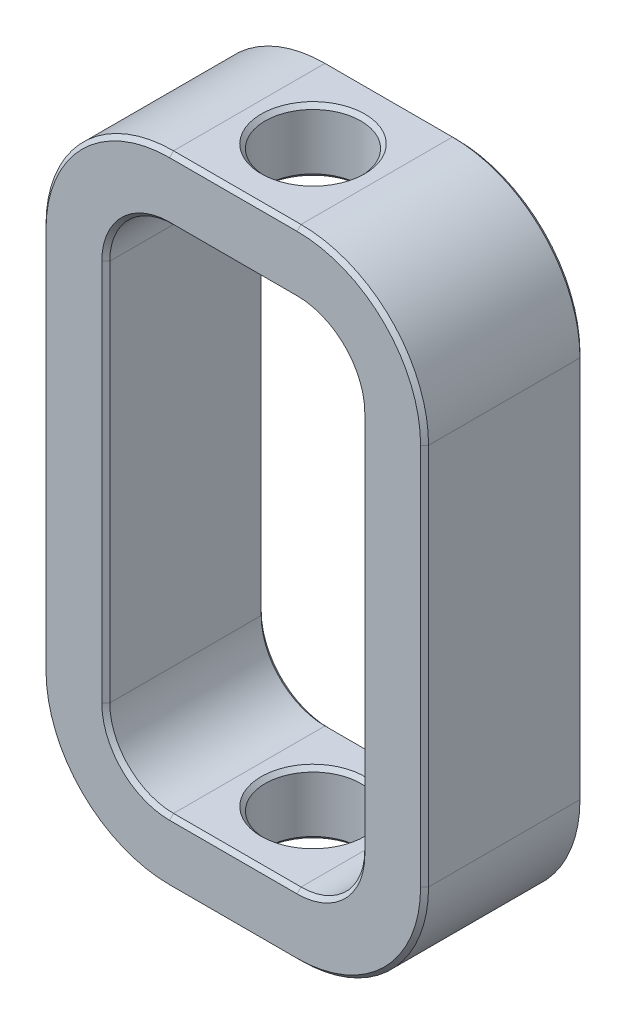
from build123d import *

# Parameters (mm, degrees)
EXTRUDE_1_DEPTH     = 10
SKETCH_2_R          = 3
CUT_EXTRUDE_1_DEPTH = 20
CHAMFER_1_SIZE      = 0.25


with BuildPart() as part:
    # Sketch 1 → Extrude 1 (new body)
    with BuildSketch(Plane.XY):
        with BuildLine():
            Line((4, 20), (-4, 20))
            ThreePointArc((-4, 20), (-9.656854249, 17.656854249), (-12, 12))
            Line((-12, 12), (-12, -12))
            ThreePointArc((-12, -12), (-9.656854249, -17.656854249), (-4, -20))
            Line((-4, -20), (4, -20))
            ThreePointArc((4, -20), (9.656854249, -17.656854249), (12, -12))
            Line((12, -12), (12, 12))
            ThreePointArc((12, 12), (9.656854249, 17.656854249), (4, 20))
        make_face()
        with BuildLine():
            Line((-8, 12), (-8, -12))
            ThreePointArc((-8, -12), (-6.828427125, -14.828427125), (-4, -16))
            Line((-4, -16), (4, -16))
            ThreePointArc((4, -16), (6.828427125, -14.828427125), (8, -12))
            Line((8, -12), (8, 12))
            ThreePointArc((8, 12), (6.828427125, 14.828427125), (4, 16))
            Line((4, 16), (-4, 16))
            ThreePointArc((-4, 16), (-6.828427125, 14.828427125), (-8, 12))
        make_face(mode=Mode.SUBTRACT)
    extrude(amount=EXTRUDE_1_DEPTH)

    # Sketch 2 → Cut-Extrude 1 (cut, symmetric)
    with BuildSketch(Plane(origin=(0, 0, 0), x_dir=(1, 0, 0), z_dir=(0, 1, 0))):
        with Locations(Location((0, -5, 0), (0, 0, 270))):
            Circle(SKETCH_2_R)
    extrude(amount=CUT_EXTRUDE_1_DEPTH, both=True, mode=Mode.SUBTRACT)

    # Chamfer 1
    chamfer_1_edges = [part.edges().sort_by_distance(p)[0] for p in [
        (9.656854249, -17.656854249, 10),
        (0, -20, 0),
        (-9.656854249, -17.656854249, 0),
        (12, 0, 10),
        (9.656854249, 17.656854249, 10),
        (0, 20, 10),
        (-9.656854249, 17.656854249, 10),
        (-12, 0, 10),
        (-6.828427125, 14.828427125, 0),
        (-8, 0, 0),
        (-6.828427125, -14.828427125, 0),
        (0, -16, 0),
        (6.828427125, -14.828427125, 0),
        (8, 0, 0),
        (6.828427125, 14.828427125, 0),
        (0, 16, 0),
        (-6.828427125, 14.828427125, 10),
        (-8, 0, 10),
        (-6.828427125, -14.828427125, 10),
        (0, -16, 10),
        (6.828427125, -14.828427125, 10),
        (8, 0, 10),
        (6.828427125, 14.828427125, 10),
        (0, 16, 10),
        (-9.656854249, -17.656854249, 10),
        (0, -20, 10),
        (-12, 0, 0),
        (0, 16, 2),
        (0, -16, 2),
        (0, -20, 2),
        (0, 20, 2),
        (-9.656854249, 17.656854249, 0),
        (0, 20, 0),
        (9.656854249, 17.656854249, 0),
        (12, 0, 0),
        (9.656854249, -17.656854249, 0),
    ]]
    chamfer(chamfer_1_edges, length=CHAMFER_1_SIZE)


solid = part.part
